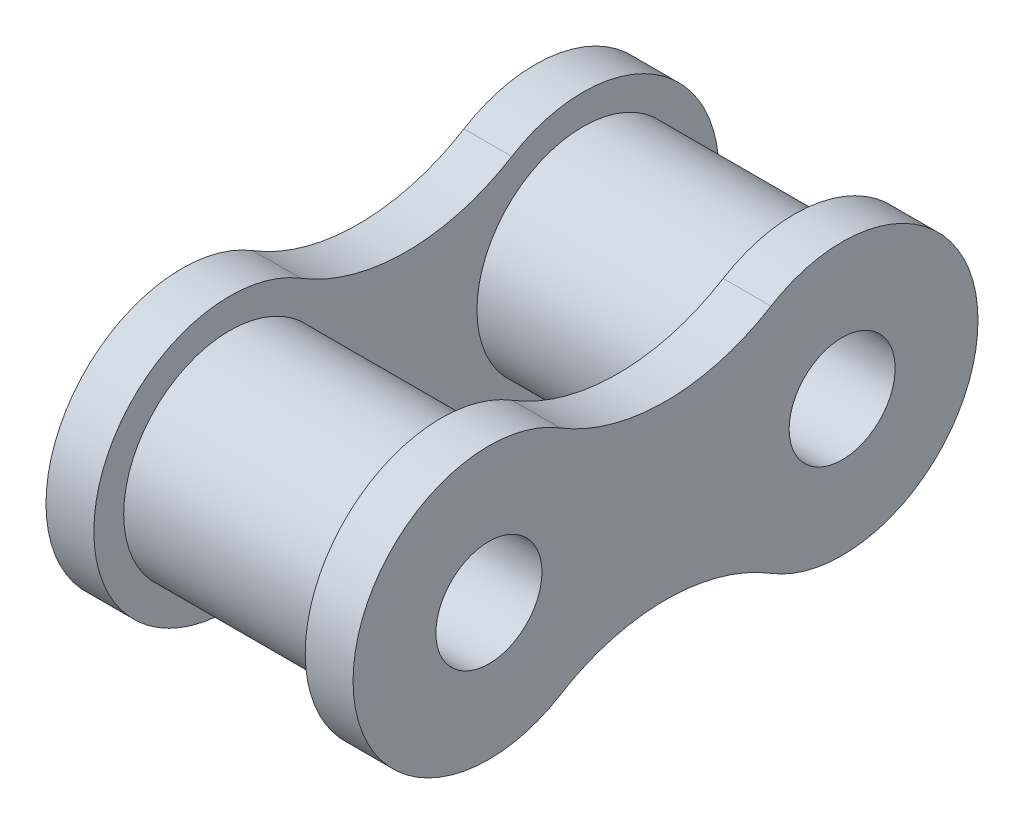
from build123d import *

# Parameters (mm, degrees)
SZKIC1_R                    = 4.765
DODANIE_WYCI_GNI_CIE1_DEPTH = 4.3
DODANIE_WYCI_GNI_CIE2_START = 19
SZKIC3_R                    = 9.525
SZKIC3_R_2                  = 4.765
DODANIE_WYCI_GNI_CIE2_DEPTH = 19
DODANIE_WYCI_GNI_CIE4_START = 4.3
SZKIC5_R                    = 4.765
DODANIE_WYCI_GNI_CIE4_DEPTH = 4.3


with BuildPart() as part:
    # Szkic1 → Dodanie-wyci_gni_cie1 (new body)
    with BuildSketch(Plane(origin=(0, 0, 0), x_dir=(0, 0, -1), z_dir=(1, 0, 0))):
        with BuildLine():
            ThreePointArc((25.357194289, -10.402698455), (43.96, 0), (25.357194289, 10.402698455))
            ThreePointArc((25.357194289, 10.402698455), (15.875, 7.722), (6.392805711, 10.402698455))
            ThreePointArc((6.392805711, 10.402698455), (-12.21, 0), (6.392805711, -10.402698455))
            ThreePointArc((6.392805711, -10.402698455), (15.875, -7.722), (25.357194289, -10.402698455))
        make_face()
        with Locations(Location((31.75, 0, 0), (0, 0, 180))):
            Circle(SZKIC1_R, mode=Mode.SUBTRACT)
        with Locations(Location((0, 0, 0), (0, 0, 180))):
            Circle(SZKIC1_R, mode=Mode.SUBTRACT)
    extrude(amount=DODANIE_WYCI_GNI_CIE1_DEPTH)

    # Szkic3 → Dodanie-wyci_gni_cie2 (add)
    # profile 1 of 2: a face of its own
    with BuildSketch(Plane.ZY.offset(DODANIE_WYCI_GNI_CIE2_START)):
        with Locations(Location((-31.75, 0, 0), (0, 0, 180))):
            Circle(SZKIC3_R)
        with Locations((-31.75, 0)):
            Circle(SZKIC3_R_2, mode=Mode.SUBTRACT)
    # profile 2 of 2: a face of its own
    with BuildSketch(Plane.ZY.offset(DODANIE_WYCI_GNI_CIE2_START)):
        with Locations(Location((0, 0, 0), (0, 0, 180))):
            Circle(SZKIC3_R)
        Circle(SZKIC3_R_2, mode=Mode.SUBTRACT)
    extrude(amount=-DODANIE_WYCI_GNI_CIE2_DEPTH)

    # Szkic5 → Dodanie-wyci_gni_cie4 (add)
    with BuildSketch(Plane.ZY.offset(19).offset(DODANIE_WYCI_GNI_CIE4_START)):
        with BuildLine():
            ThreePointArc((-25.357194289, 10.402698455), (-15.875, 7.722), (-6.392805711, 10.402698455))
            ThreePointArc((-6.392805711, 10.402698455), (12.21, 0), (-6.392805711, -10.402698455))
            ThreePointArc((-6.392805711, -10.402698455), (-15.875, -7.722), (-25.357194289, -10.402698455))
            ThreePointArc((-25.357194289, -10.402698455), (-43.96, 0), (-25.357194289, 10.402698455))
        make_face()
        Circle(SZKIC5_R, mode=Mode.SUBTRACT)
        with Locations((-31.75, 0)):
            Circle(SZKIC5_R, mode=Mode.SUBTRACT)
    extrude(amount=-DODANIE_WYCI_GNI_CIE4_DEPTH)


solid = part.part
